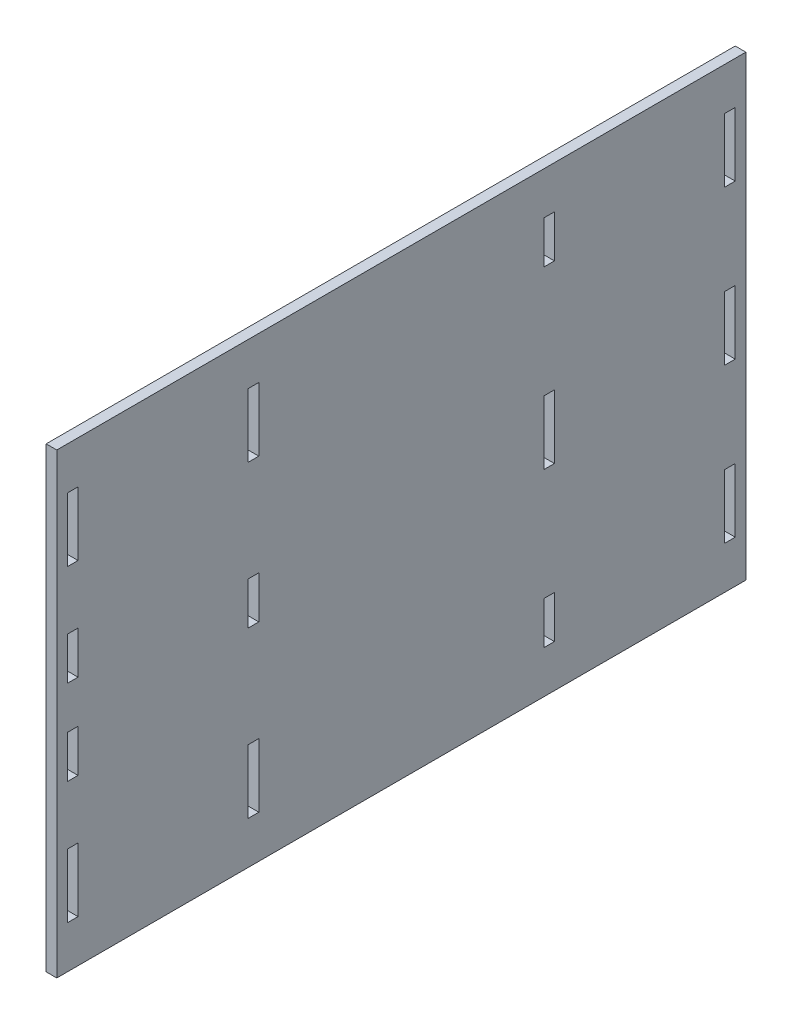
from build123d import *

# Parameters (mm, degrees)
SKETCH1_W           = 205.74
SKETCH1_H           = 136.525
BOSS_EXTRUDE1_DEPTH = 3.175
SKETCH2_W           = 3.175
SKETCH2_H           = 19.05
SKETCH2_H_2         = 12.7
CUT_EXTRUDE4_DEPTH  = 247.937449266


with BuildPart() as part:
    # Sketch1 → Boss-Extrude1 (new body)
    with BuildSketch(Plane(origin=(0, 0, 0), x_dir=(0, 0, -1), z_dir=(1, 0, 0))):
        with Locations((102.87, 68.2625)):
            Rectangle(SKETCH1_W, SKETCH1_H)
    extrude(amount=BOSS_EXTRUDE1_DEPTH)

    # Sketch2 → Cut-Extrude4 (cut, through all)
    with BuildSketch(Plane(origin=(3.175, 0, 0), x_dir=(0, 0, -1), z_dir=(1, 0, 0))):
        with Locations((4.7625, 114.3)):
            Rectangle(SKETCH2_W, SKETCH2_H)
        with Locations((4.7625, 80.9625)):
            Rectangle(SKETCH2_W, SKETCH2_H_2)
        with Locations((4.7625, 22.225)):
            Rectangle(SKETCH2_W, SKETCH2_H)
        with Locations((58.7375, 22.225)):
            Rectangle(SKETCH2_W, SKETCH2_H)
        with Locations((58.7375, 114.3)):
            Rectangle(SKETCH2_W, SKETCH2_H)
        with Locations((58.7375, 68.2625)):
            Rectangle(SKETCH2_W, SKETCH2_H_2)
        with Locations((147.0025, 19.05)):
            Rectangle(SKETCH2_W, SKETCH2_H_2)
        with Locations((147.0025, 117.475)):
            Rectangle(SKETCH2_W, SKETCH2_H_2)
        with Locations((147.0025, 68.2625)):
            Rectangle(SKETCH2_W, SKETCH2_H)
        with Locations((200.9775, 22.225)):
            Rectangle(SKETCH2_W, SKETCH2_H)
        with Locations((200.9775, 114.3)):
            Rectangle(SKETCH2_W, SKETCH2_H)
        with Locations((200.9775, 68.2625)):
            Rectangle(SKETCH2_W, SKETCH2_H)
        with Locations((4.7625, 55.5625)):
            Rectangle(SKETCH2_W, SKETCH2_H_2)
    extrude(amount=-CUT_EXTRUDE4_DEPTH, mode=Mode.SUBTRACT)


solid = part.part
